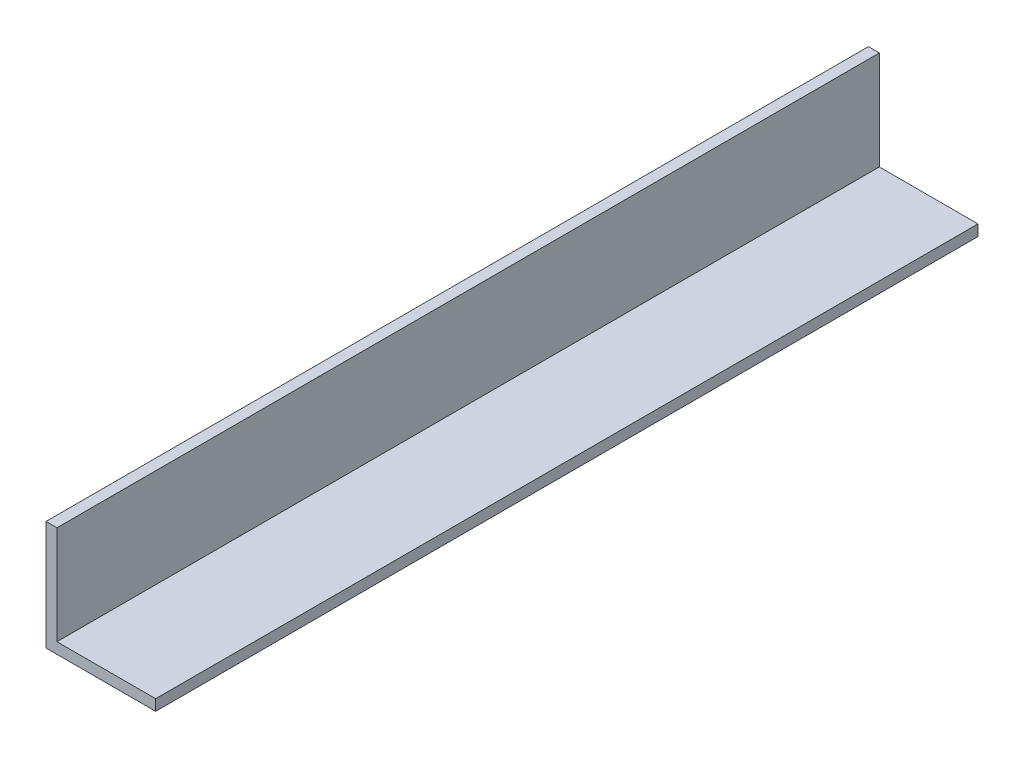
from build123d import *

# Parameters (mm, degrees)
EXTRUDE_1_DEPTH = 150


with BuildPart() as part:
    # Sketch 1 → Extrude 1 (new, symmetric)
    with BuildSketch(Plane.XY):
        Polygon((0, 0), (0, 36), (-4, 36), (-4, -4), (36, -4), (36, 0), align=None)
    extrude(amount=EXTRUDE_1_DEPTH, both=True)


solid = part.part
